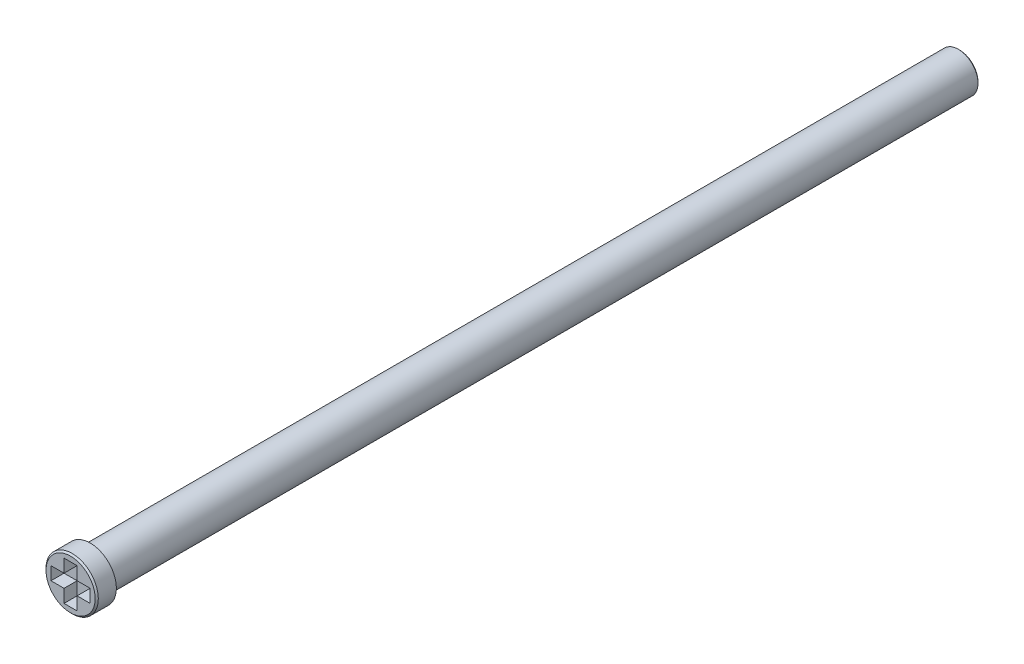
ISO-10303-21;
HEADER;
FILE_DESCRIPTION(('STEP AP214'),'2;1');
FILE_NAME('part.step','',(''),(''),'','','');
FILE_SCHEMA(('AUTOMOTIVE_DESIGN { 1 0 10303 214 1 1 1 1 }'));
ENDSEC;
DATA;
#1=APPLICATION_CONTEXT('core data for automotive mechanical design processes');
#2=APPLICATION_PROTOCOL_DEFINITION('international standard','automotive_design',2000,#1);
#3=PRODUCT_CONTEXT('',#1,'mechanical');
#4=PRODUCT('Part','Part','',(#3));
#5=PRODUCT_RELATED_PRODUCT_CATEGORY('part','',(#4));
#6=PRODUCT_DEFINITION_FORMATION('','',#4);
#7=PRODUCT_DEFINITION_CONTEXT('part definition',#1,'design');
#8=PRODUCT_DEFINITION('design','',#6,#7);
#9=PRODUCT_DEFINITION_SHAPE('','',#8);
#10=(LENGTH_UNIT() NAMED_UNIT(*) SI_UNIT(.MILLI.,.METRE.));
#11=(NAMED_UNIT(*) PLANE_ANGLE_UNIT() SI_UNIT($,.RADIAN.));
#12=(NAMED_UNIT(*) SI_UNIT($,.STERADIAN.) SOLID_ANGLE_UNIT());
#13=UNCERTAINTY_MEASURE_WITH_UNIT(LENGTH_MEASURE(1.E-05),#10,'distance_accuracy_value','');
#14=(GEOMETRIC_REPRESENTATION_CONTEXT(3) GLOBAL_UNCERTAINTY_ASSIGNED_CONTEXT((#13)) GLOBAL_UNIT_ASSIGNED_CONTEXT((#10,
#11,#12)) REPRESENTATION_CONTEXT('',''));
#15=CARTESIAN_POINT('',(0.,0.,0.));
#16=DIRECTION('',(0.,0.,1.));
#17=DIRECTION('',(1.,0.,0.));
#18=AXIS2_PLACEMENT_3D('',#15,#16,#17);
#19=CARTESIAN_POINT('',(0.,0.,68.));
#20=DIRECTION('',(0.,0.,-1.));
#21=DIRECTION('',(-1.,0.,0.));
#22=AXIS2_PLACEMENT_3D('',#19,#20,#21);
#23=CYLINDRICAL_SURFACE('',#22,2.);
#24=CARTESIAN_POINT('',(0.,0.,67.88));
#25=DIRECTION('',(0.,0.,1.));
#26=DIRECTION('',(1.,0.,0.));
#27=AXIS2_PLACEMENT_3D('',#24,#25,#26);
#28=CIRCLE('',#27,2.);
#29=CARTESIAN_POINT('',(2.,0.,67.88));
#30=VERTEX_POINT('',#29);
#31=EDGE_CURVE('E12',#30,#30,#28,.F.);
#32=ORIENTED_EDGE('',*,*,#31,.T.);
#33=EDGE_LOOP('',(#32));
#34=FACE_BOUND('',#33,.T.);
#35=CARTESIAN_POINT('',(0.,0.,66.5));
#36=DIRECTION('',(0.,0.,-1.));
#37=DIRECTION('',(-1.,0.,0.));
#38=AXIS2_PLACEMENT_3D('',#35,#36,#37);
#39=CIRCLE('',#38,2.);
#40=CARTESIAN_POINT('',(-2.,0.,66.5));
#41=VERTEX_POINT('',#40);
#42=EDGE_CURVE('E212',#41,#41,#39,.T.);
#43=ORIENTED_EDGE('',*,*,#42,.F.);
#44=EDGE_LOOP('',(#43));
#45=FACE_BOUND('',#44,.T.);
#46=ADVANCED_FACE('F36',(#34,#45),#23,.T.);
#47=CARTESIAN_POINT('',(0.,0.,68.));
#48=DIRECTION('',(0.,0.,1.));
#49=DIRECTION('',(1.,0.,0.));
#50=AXIS2_PLACEMENT_3D('',#47,#48,#49);
#51=PLANE('',#50);
#52=DIRECTION('',(1.,0.,0.));
#53=VECTOR('',#52,1.);
#54=CARTESIAN_POINT('',(-0.5,-0.5,68.));
#55=LINE('',#54,#53);
#56=CARTESIAN_POINT('',(-1.5,-0.5,68.));
#57=VERTEX_POINT('',#56);
#58=CARTESIAN_POINT('',(-0.5,-0.5,68.));
#59=VERTEX_POINT('',#58);
#60=EDGE_CURVE('E51',#57,#59,#55,.T.);
#61=ORIENTED_EDGE('',*,*,#60,.F.);
#62=DIRECTION('',(0.,-1.,0.));
#63=VECTOR('',#62,1.);
#64=CARTESIAN_POINT('',(-1.5,0.5,68.));
#65=LINE('',#64,#63);
#66=CARTESIAN_POINT('',(-1.5,0.5,68.));
#67=VERTEX_POINT('',#66);
#68=EDGE_CURVE('E188',#67,#57,#65,.T.);
#69=ORIENTED_EDGE('',*,*,#68,.F.);
#70=DIRECTION('',(-1.,0.,0.));
#71=VECTOR('',#70,1.);
#72=CARTESIAN_POINT('',(-0.5,0.5,68.));
#73=LINE('',#72,#71);
#74=CARTESIAN_POINT('',(-0.5,0.5,68.));
#75=VERTEX_POINT('',#74);
#76=EDGE_CURVE('E186',#75,#67,#73,.T.);
#77=ORIENTED_EDGE('',*,*,#76,.F.);
#78=DIRECTION('',(0.,-1.,0.));
#79=VECTOR('',#78,1.);
#80=CARTESIAN_POINT('',(-0.5,0.5,68.));
#81=LINE('',#80,#79);
#82=CARTESIAN_POINT('',(-0.5,1.5,68.));
#83=VERTEX_POINT('',#82);
#84=EDGE_CURVE('E135',#83,#75,#81,.T.);
#85=ORIENTED_EDGE('',*,*,#84,.F.);
#86=DIRECTION('',(-1.,0.,0.));
#87=VECTOR('',#86,1.);
#88=CARTESIAN_POINT('',(0.5,1.5,68.));
#89=LINE('',#88,#87);
#90=CARTESIAN_POINT('',(0.5,1.5,68.));
#91=VERTEX_POINT('',#90);
#92=EDGE_CURVE('E182',#91,#83,#89,.T.);
#93=ORIENTED_EDGE('',*,*,#92,.F.);
#94=DIRECTION('',(0.,1.,0.));
#95=VECTOR('',#94,1.);
#96=CARTESIAN_POINT('',(0.5,0.5,68.));
#97=LINE('',#96,#95);
#98=CARTESIAN_POINT('',(0.5,0.5,68.));
#99=VERTEX_POINT('',#98);
#100=EDGE_CURVE('E179',#99,#91,#97,.T.);
#101=ORIENTED_EDGE('',*,*,#100,.F.);
#102=DIRECTION('',(-1.,0.,0.));
#103=VECTOR('',#102,1.);
#104=CARTESIAN_POINT('',(1.5,0.5,68.));
#105=LINE('',#104,#103);
#106=CARTESIAN_POINT('',(1.5,0.5,68.));
#107=VERTEX_POINT('',#106);
#108=EDGE_CURVE('E176',#107,#99,#105,.T.);
#109=ORIENTED_EDGE('',*,*,#108,.F.);
#110=DIRECTION('',(0.,1.,0.));
#111=VECTOR('',#110,1.);
#112=CARTESIAN_POINT('',(1.5,0.5,68.));
#113=LINE('',#112,#111);
#114=CARTESIAN_POINT('',(1.5,-0.5,68.));
#115=VERTEX_POINT('',#114);
#116=EDGE_CURVE('E173',#115,#107,#113,.T.);
#117=ORIENTED_EDGE('',*,*,#116,.F.);
#118=DIRECTION('',(1.,0.,0.));
#119=VECTOR('',#118,1.);
#120=CARTESIAN_POINT('',(1.5,-0.5,68.));
#121=LINE('',#120,#119);
#122=CARTESIAN_POINT('',(0.5,-0.5,68.));
#123=VERTEX_POINT('',#122);
#124=EDGE_CURVE('E170',#123,#115,#121,.T.);
#125=ORIENTED_EDGE('',*,*,#124,.F.);
#126=DIRECTION('',(0.,1.,0.));
#127=VECTOR('',#126,1.);
#128=CARTESIAN_POINT('',(0.5,-1.5,68.));
#129=LINE('',#128,#127);
#130=CARTESIAN_POINT('',(0.5,-1.5,68.));
#131=VERTEX_POINT('',#130);
#132=EDGE_CURVE('E167',#131,#123,#129,.T.);
#133=ORIENTED_EDGE('',*,*,#132,.F.);
#134=DIRECTION('',(1.,0.,0.));
#135=VECTOR('',#134,1.);
#136=CARTESIAN_POINT('',(0.5,-1.5,68.));
#137=LINE('',#136,#135);
#138=CARTESIAN_POINT('',(-0.5,-1.5,68.));
#139=VERTEX_POINT('',#138);
#140=EDGE_CURVE('E164',#139,#131,#137,.T.);
#141=ORIENTED_EDGE('',*,*,#140,.F.);
#142=DIRECTION('',(0.,-1.,0.));
#143=VECTOR('',#142,1.);
#144=CARTESIAN_POINT('',(-0.5,-1.5,68.));
#145=LINE('',#144,#143);
#146=EDGE_CURVE('E161',#59,#139,#145,.T.);
#147=ORIENTED_EDGE('',*,*,#146,.F.);
#148=EDGE_LOOP('',(#61,#69,#77,#85,#93,#101,#109,#117,#125,#133,#141,#147));
#149=FACE_BOUND('',#148,.T.);
#150=CARTESIAN_POINT('',(0.,0.,68.));
#151=DIRECTION('',(0.,0.,1.));
#152=DIRECTION('',(1.,0.,0.));
#153=AXIS2_PLACEMENT_3D('',#150,#151,#152);
#154=CIRCLE('',#153,1.88000000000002);
#155=CARTESIAN_POINT('',(1.88000000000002,0.,68.));
#156=VERTEX_POINT('',#155);
#157=EDGE_CURVE('E44',#156,#156,#154,.T.);
#158=ORIENTED_EDGE('',*,*,#157,.T.);
#159=EDGE_LOOP('',(#158));
#160=FACE_BOUND('',#159,.T.);
#161=ADVANCED_FACE('F223',(#149,#160),#51,.T.);
#162=CARTESIAN_POINT('',(0.,0.,66.5));
#163=DIRECTION('',(0.,0.,-1.));
#164=DIRECTION('',(-1.,0.,0.));
#165=AXIS2_PLACEMENT_3D('',#162,#163,#164);
#166=PLANE('',#165);
#167=CARTESIAN_POINT('',(0.,0.,66.5));
#168=DIRECTION('',(0.,0.,-1.));
#169=DIRECTION('',(-1.,0.,0.));
#170=AXIS2_PLACEMENT_3D('',#167,#168,#169);
#171=CIRCLE('',#170,1.5);
#172=CARTESIAN_POINT('',(-1.5,0.,66.5));
#173=VERTEX_POINT('',#172);
#174=EDGE_CURVE('E192',#173,#173,#171,.T.);
#175=ORIENTED_EDGE('',*,*,#174,.F.);
#176=EDGE_LOOP('',(#175));
#177=FACE_BOUND('',#176,.T.);
#178=ORIENTED_EDGE('',*,*,#42,.T.);
#179=EDGE_LOOP('',(#178));
#180=FACE_BOUND('',#179,.T.);
#181=ADVANCED_FACE('F244',(#177,#180),#166,.T.);
#182=CARTESIAN_POINT('',(0.,0.,66.5));
#183=DIRECTION('',(0.,0.,-1.));
#184=DIRECTION('',(-1.,0.,0.));
#185=AXIS2_PLACEMENT_3D('',#182,#183,#184);
#186=CYLINDRICAL_SURFACE('',#185,1.5);
#187=CARTESIAN_POINT('',(0.,0.,0.100000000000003));
#188=DIRECTION('',(0.,0.,1.));
#189=DIRECTION('',(1.,0.,0.));
#190=AXIS2_PLACEMENT_3D('',#187,#188,#189);
#191=CIRCLE('',#190,1.5);
#192=CARTESIAN_POINT('',(1.5,0.,0.100000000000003));
#193=VERTEX_POINT('',#192);
#194=EDGE_CURVE('E218',#193,#193,#191,.T.);
#195=ORIENTED_EDGE('',*,*,#194,.T.);
#196=EDGE_LOOP('',(#195));
#197=FACE_BOUND('',#196,.T.);
#198=ORIENTED_EDGE('',*,*,#174,.T.);
#199=EDGE_LOOP('',(#198));
#200=FACE_BOUND('',#199,.T.);
#201=ADVANCED_FACE('F250',(#197,#200),#186,.T.);
#202=CARTESIAN_POINT('',(0.,0.,0.));
#203=DIRECTION('',(0.,0.,1.));
#204=DIRECTION('',(1.,0.,0.));
#205=AXIS2_PLACEMENT_3D('',#202,#203,#204);
#206=PLANE('',#205);
#207=CARTESIAN_POINT('',(0.,0.,0.));
#208=DIRECTION('',(0.,0.,1.));
#209=DIRECTION('',(1.,0.,0.));
#210=AXIS2_PLACEMENT_3D('',#207,#208,#209);
#211=CIRCLE('',#210,1.39999999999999);
#212=CARTESIAN_POINT('',(1.39999999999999,0.,0.));
#213=VERTEX_POINT('',#212);
#214=EDGE_CURVE('E215',#213,#213,#211,.F.);
#215=ORIENTED_EDGE('',*,*,#214,.T.);
#216=EDGE_LOOP('',(#215));
#217=FACE_BOUND('',#216,.T.);
#218=ADVANCED_FACE('F235',(#217),#206,.F.);
#219=CARTESIAN_POINT('',(0.,0.,0.));
#220=DIRECTION('',(0.,0.,1.));
#221=DIRECTION('',(1.,0.,0.));
#222=AXIS2_PLACEMENT_3D('',#219,#220,#221);
#223=CONICAL_SURFACE('',#222,1.39999999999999,0.785398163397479);
#224=ORIENTED_EDGE('',*,*,#194,.F.);
#225=EDGE_LOOP('',(#224));
#226=FACE_BOUND('',#225,.T.);
#227=ORIENTED_EDGE('',*,*,#214,.F.);
#228=EDGE_LOOP('',(#227));
#229=FACE_BOUND('',#228,.T.);
#230=ADVANCED_FACE('F227',(#226,#229),#223,.T.);
#231=CARTESIAN_POINT('',(0.,0.,68.));
#232=DIRECTION('',(0.,0.,-1.));
#233=DIRECTION('',(-1.,0.,0.));
#234=AXIS2_PLACEMENT_3D('',#231,#232,#233);
#235=CONICAL_SURFACE('',#234,1.88000000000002,0.785398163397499);
#236=ORIENTED_EDGE('',*,*,#31,.F.);
#237=EDGE_LOOP('',(#236));
#238=FACE_BOUND('',#237,.T.);
#239=ORIENTED_EDGE('',*,*,#157,.F.);
#240=EDGE_LOOP('',(#239));
#241=FACE_BOUND('',#240,.T.);
#242=ADVANCED_FACE('F38',(#238,#241),#235,.T.);
#243=CARTESIAN_POINT('',(-0.5,-0.5,67.));
#244=DIRECTION('',(0.,-1.,0.));
#245=DIRECTION('',(1.,0.,0.));
#246=AXIS2_PLACEMENT_3D('',#243,#244,#245);
#247=PLANE('',#246);
#248=ORIENTED_EDGE('',*,*,#60,.T.);
#249=DIRECTION('',(0.,0.,1.));
#250=VECTOR('',#249,1.);
#251=CARTESIAN_POINT('',(-0.5,-0.5,67.));
#252=LINE('',#251,#250);
#253=CARTESIAN_POINT('',(-0.5,-0.5,67.));
#254=VERTEX_POINT('',#253);
#255=EDGE_CURVE('E99',#254,#59,#252,.T.);
#256=ORIENTED_EDGE('',*,*,#255,.F.);
#257=DIRECTION('',(1.,0.,0.));
#258=VECTOR('',#257,1.);
#259=CARTESIAN_POINT('',(-0.5,-0.5,67.));
#260=LINE('',#259,#258);
#261=CARTESIAN_POINT('',(-1.5,-0.5,67.));
#262=VERTEX_POINT('',#261);
#263=EDGE_CURVE('E190',#262,#254,#260,.T.);
#264=ORIENTED_EDGE('',*,*,#263,.F.);
#265=DIRECTION('',(0.,0.,1.));
#266=VECTOR('',#265,1.);
#267=CARTESIAN_POINT('',(-1.5,-0.5,67.));
#268=LINE('',#267,#266);
#269=EDGE_CURVE('E59',#262,#57,#268,.T.);
#270=ORIENTED_EDGE('',*,*,#269,.T.);
#271=EDGE_LOOP('',(#248,#256,#264,#270));
#272=FACE_BOUND('',#271,.T.);
#273=ADVANCED_FACE('F226',(#272),#247,.F.);
#274=CARTESIAN_POINT('',(-1.5,0.5,67.));
#275=DIRECTION('',(-1.,0.,0.));
#276=DIRECTION('',(0.,-1.,0.));
#277=AXIS2_PLACEMENT_3D('',#274,#275,#276);
#278=PLANE('',#277);
#279=ORIENTED_EDGE('',*,*,#68,.T.);
#280=ORIENTED_EDGE('',*,*,#269,.F.);
#281=DIRECTION('',(0.,-1.,0.));
#282=VECTOR('',#281,1.);
#283=CARTESIAN_POINT('',(-1.5,0.5,67.));
#284=LINE('',#283,#282);
#285=CARTESIAN_POINT('',(-1.5,0.5,67.));
#286=VERTEX_POINT('',#285);
#287=EDGE_CURVE('E147',#286,#262,#284,.T.);
#288=ORIENTED_EDGE('',*,*,#287,.F.);
#289=DIRECTION('',(0.,0.,1.));
#290=VECTOR('',#289,1.);
#291=CARTESIAN_POINT('',(-1.5,0.5,67.));
#292=LINE('',#291,#290);
#293=EDGE_CURVE('E139',#286,#67,#292,.T.);
#294=ORIENTED_EDGE('',*,*,#293,.T.);
#295=EDGE_LOOP('',(#279,#280,#288,#294));
#296=FACE_BOUND('',#295,.T.);
#297=ADVANCED_FACE('F233',(#296),#278,.F.);
#298=CARTESIAN_POINT('',(-0.5,0.5,67.));
#299=DIRECTION('',(0.,1.,0.));
#300=DIRECTION('',(0.,0.,1.));
#301=AXIS2_PLACEMENT_3D('',#298,#299,#300);
#302=PLANE('',#301);
#303=ORIENTED_EDGE('',*,*,#76,.T.);
#304=ORIENTED_EDGE('',*,*,#293,.F.);
#305=DIRECTION('',(-1.,0.,0.));
#306=VECTOR('',#305,1.);
#307=CARTESIAN_POINT('',(-0.5,0.5,67.));
#308=LINE('',#307,#306);
#309=CARTESIAN_POINT('',(-0.5,0.5,67.));
#310=VERTEX_POINT('',#309);
#311=EDGE_CURVE('E143',#310,#286,#308,.T.);
#312=ORIENTED_EDGE('',*,*,#311,.F.);
#313=DIRECTION('',(0.,0.,1.));
#314=VECTOR('',#313,1.);
#315=CARTESIAN_POINT('',(-0.5,0.5,67.));
#316=LINE('',#315,#314);
#317=EDGE_CURVE('E128',#310,#75,#316,.T.);
#318=ORIENTED_EDGE('',*,*,#317,.T.);
#319=EDGE_LOOP('',(#303,#304,#312,#318));
#320=FACE_BOUND('',#319,.T.);
#321=ADVANCED_FACE('F144',(#320),#302,.F.);
#322=CARTESIAN_POINT('',(-0.5,0.5,67.));
#323=DIRECTION('',(-1.,0.,0.));
#324=DIRECTION('',(0.,-1.,0.));
#325=AXIS2_PLACEMENT_3D('',#322,#323,#324);
#326=PLANE('',#325);
#327=ORIENTED_EDGE('',*,*,#84,.T.);
#328=ORIENTED_EDGE('',*,*,#317,.F.);
#329=DIRECTION('',(0.,-1.,0.));
#330=VECTOR('',#329,1.);
#331=CARTESIAN_POINT('',(-0.5,0.5,67.));
#332=LINE('',#331,#330);
#333=CARTESIAN_POINT('',(-0.5,1.5,67.));
#334=VERTEX_POINT('',#333);
#335=EDGE_CURVE('E132',#334,#310,#332,.T.);
#336=ORIENTED_EDGE('',*,*,#335,.F.);
#337=DIRECTION('',(0.,0.,1.));
#338=VECTOR('',#337,1.);
#339=CARTESIAN_POINT('',(-0.5,1.5,67.));
#340=LINE('',#339,#338);
#341=EDGE_CURVE('E140',#334,#83,#340,.T.);
#342=ORIENTED_EDGE('',*,*,#341,.T.);
#343=EDGE_LOOP('',(#327,#328,#336,#342));
#344=FACE_BOUND('',#343,.T.);
#345=ADVANCED_FACE('F130',(#344),#326,.F.);
#346=CARTESIAN_POINT('',(0.5,1.5,67.));
#347=DIRECTION('',(0.,1.,0.));
#348=DIRECTION('',(-1.,0.,0.));
#349=AXIS2_PLACEMENT_3D('',#346,#347,#348);
#350=PLANE('',#349);
#351=ORIENTED_EDGE('',*,*,#92,.T.);
#352=ORIENTED_EDGE('',*,*,#341,.F.);
#353=DIRECTION('',(-1.,0.,0.));
#354=VECTOR('',#353,1.);
#355=CARTESIAN_POINT('',(0.5,1.5,67.));
#356=LINE('',#355,#354);
#357=CARTESIAN_POINT('',(0.5,1.5,67.));
#358=VERTEX_POINT('',#357);
#359=EDGE_CURVE('E153',#358,#334,#356,.T.);
#360=ORIENTED_EDGE('',*,*,#359,.F.);
#361=DIRECTION('',(0.,0.,1.));
#362=VECTOR('',#361,1.);
#363=CARTESIAN_POINT('',(0.5,1.5,67.));
#364=LINE('',#363,#362);
#365=EDGE_CURVE('E195',#358,#91,#364,.T.);
#366=ORIENTED_EDGE('',*,*,#365,.T.);
#367=EDGE_LOOP('',(#351,#352,#360,#366));
#368=FACE_BOUND('',#367,.T.);
#369=ADVANCED_FACE('F286',(#368),#350,.F.);
#370=CARTESIAN_POINT('',(0.5,0.5,67.));
#371=DIRECTION('',(1.,0.,0.));
#372=DIRECTION('',(0.,1.,0.));
#373=AXIS2_PLACEMENT_3D('',#370,#371,#372);
#374=PLANE('',#373);
#375=ORIENTED_EDGE('',*,*,#100,.T.);
#376=ORIENTED_EDGE('',*,*,#365,.F.);
#377=DIRECTION('',(0.,1.,0.));
#378=VECTOR('',#377,1.);
#379=CARTESIAN_POINT('',(0.5,0.5,67.));
#380=LINE('',#379,#378);
#381=CARTESIAN_POINT('',(0.5,0.5,67.));
#382=VERTEX_POINT('',#381);
#383=EDGE_CURVE('E155',#382,#358,#380,.T.);
#384=ORIENTED_EDGE('',*,*,#383,.F.);
#385=DIRECTION('',(0.,0.,1.));
#386=VECTOR('',#385,1.);
#387=CARTESIAN_POINT('',(0.5,0.5,67.));
#388=LINE('',#387,#386);
#389=EDGE_CURVE('E197',#382,#99,#388,.T.);
#390=ORIENTED_EDGE('',*,*,#389,.T.);
#391=EDGE_LOOP('',(#375,#376,#384,#390));
#392=FACE_BOUND('',#391,.T.);
#393=ADVANCED_FACE('F282',(#392),#374,.F.);
#394=CARTESIAN_POINT('',(1.5,0.5,67.));
#395=DIRECTION('',(0.,1.,0.));
#396=DIRECTION('',(-1.,0.,0.));
#397=AXIS2_PLACEMENT_3D('',#394,#395,#396);
#398=PLANE('',#397);
#399=ORIENTED_EDGE('',*,*,#108,.T.);
#400=ORIENTED_EDGE('',*,*,#389,.F.);
#401=DIRECTION('',(-1.,0.,0.));
#402=VECTOR('',#401,1.);
#403=CARTESIAN_POINT('',(1.5,0.5,67.));
#404=LINE('',#403,#402);
#405=CARTESIAN_POINT('',(1.5,0.5,67.));
#406=VERTEX_POINT('',#405);
#407=EDGE_CURVE('E436',#406,#382,#404,.T.);
#408=ORIENTED_EDGE('',*,*,#407,.F.);
#409=DIRECTION('',(0.,0.,1.));
#410=VECTOR('',#409,1.);
#411=CARTESIAN_POINT('',(1.5,0.5,67.));
#412=LINE('',#411,#410);
#413=EDGE_CURVE('E199',#406,#107,#412,.T.);
#414=ORIENTED_EDGE('',*,*,#413,.T.);
#415=EDGE_LOOP('',(#399,#400,#408,#414));
#416=FACE_BOUND('',#415,.T.);
#417=ADVANCED_FACE('F278',(#416),#398,.F.);
#418=CARTESIAN_POINT('',(1.5,0.5,67.));
#419=DIRECTION('',(1.,0.,0.));
#420=DIRECTION('',(0.,1.,0.));
#421=AXIS2_PLACEMENT_3D('',#418,#419,#420);
#422=PLANE('',#421);
#423=ORIENTED_EDGE('',*,*,#116,.T.);
#424=ORIENTED_EDGE('',*,*,#413,.F.);
#425=DIRECTION('',(0.,1.,0.));
#426=VECTOR('',#425,1.);
#427=CARTESIAN_POINT('',(1.5,0.5,67.));
#428=LINE('',#427,#426);
#429=CARTESIAN_POINT('',(1.5,-0.5,67.));
#430=VERTEX_POINT('',#429);
#431=EDGE_CURVE('E433',#430,#406,#428,.T.);
#432=ORIENTED_EDGE('',*,*,#431,.F.);
#433=DIRECTION('',(0.,0.,1.));
#434=VECTOR('',#433,1.);
#435=CARTESIAN_POINT('',(1.5,-0.5,67.));
#436=LINE('',#435,#434);
#437=EDGE_CURVE('E201',#430,#115,#436,.T.);
#438=ORIENTED_EDGE('',*,*,#437,.T.);
#439=EDGE_LOOP('',(#423,#424,#432,#438));
#440=FACE_BOUND('',#439,.T.);
#441=ADVANCED_FACE('F274',(#440),#422,.F.);
#442=CARTESIAN_POINT('',(1.5,-0.5,67.));
#443=DIRECTION('',(0.,-1.,0.));
#444=DIRECTION('',(0.,0.,-1.));
#445=AXIS2_PLACEMENT_3D('',#442,#443,#444);
#446=PLANE('',#445);
#447=ORIENTED_EDGE('',*,*,#124,.T.);
#448=ORIENTED_EDGE('',*,*,#437,.F.);
#449=DIRECTION('',(1.,0.,0.));
#450=VECTOR('',#449,1.);
#451=CARTESIAN_POINT('',(1.5,-0.5,67.));
#452=LINE('',#451,#450);
#453=CARTESIAN_POINT('',(0.5,-0.5,67.));
#454=VERTEX_POINT('',#453);
#455=EDGE_CURVE('E430',#454,#430,#452,.T.);
#456=ORIENTED_EDGE('',*,*,#455,.F.);
#457=DIRECTION('',(0.,0.,1.));
#458=VECTOR('',#457,1.);
#459=CARTESIAN_POINT('',(0.5,-0.5,67.));
#460=LINE('',#459,#458);
#461=EDGE_CURVE('E203',#454,#123,#460,.T.);
#462=ORIENTED_EDGE('',*,*,#461,.T.);
#463=EDGE_LOOP('',(#447,#448,#456,#462));
#464=FACE_BOUND('',#463,.T.);
#465=ADVANCED_FACE('F270',(#464),#446,.F.);
#466=CARTESIAN_POINT('',(0.5,-1.5,67.));
#467=DIRECTION('',(1.,0.,0.));
#468=DIRECTION('',(0.,0.,-1.));
#469=AXIS2_PLACEMENT_3D('',#466,#467,#468);
#470=PLANE('',#469);
#471=ORIENTED_EDGE('',*,*,#132,.T.);
#472=ORIENTED_EDGE('',*,*,#461,.F.);
#473=DIRECTION('',(0.,1.,0.));
#474=VECTOR('',#473,1.);
#475=CARTESIAN_POINT('',(0.5,-1.5,67.));
#476=LINE('',#475,#474);
#477=CARTESIAN_POINT('',(0.5,-1.5,67.));
#478=VERTEX_POINT('',#477);
#479=EDGE_CURVE('E427',#478,#454,#476,.T.);
#480=ORIENTED_EDGE('',*,*,#479,.F.);
#481=DIRECTION('',(0.,0.,1.));
#482=VECTOR('',#481,1.);
#483=CARTESIAN_POINT('',(0.5,-1.5,67.));
#484=LINE('',#483,#482);
#485=EDGE_CURVE('E205',#478,#131,#484,.T.);
#486=ORIENTED_EDGE('',*,*,#485,.T.);
#487=EDGE_LOOP('',(#471,#472,#480,#486));
#488=FACE_BOUND('',#487,.T.);
#489=ADVANCED_FACE('F266',(#488),#470,.F.);
#490=CARTESIAN_POINT('',(0.5,-1.5,67.));
#491=DIRECTION('',(0.,-1.,0.));
#492=DIRECTION('',(0.,0.,-1.));
#493=AXIS2_PLACEMENT_3D('',#490,#491,#492);
#494=PLANE('',#493);
#495=ORIENTED_EDGE('',*,*,#140,.T.);
#496=ORIENTED_EDGE('',*,*,#485,.F.);
#497=DIRECTION('',(1.,0.,0.));
#498=VECTOR('',#497,1.);
#499=CARTESIAN_POINT('',(0.5,-1.5,67.));
#500=LINE('',#499,#498);
#501=CARTESIAN_POINT('',(-0.5,-1.5,67.));
#502=VERTEX_POINT('',#501);
#503=EDGE_CURVE('E422',#502,#478,#500,.T.);
#504=ORIENTED_EDGE('',*,*,#503,.F.);
#505=DIRECTION('',(0.,0.,1.));
#506=VECTOR('',#505,1.);
#507=CARTESIAN_POINT('',(-0.5,-1.5,67.));
#508=LINE('',#507,#506);
#509=EDGE_CURVE('E207',#502,#139,#508,.T.);
#510=ORIENTED_EDGE('',*,*,#509,.T.);
#511=EDGE_LOOP('',(#495,#496,#504,#510));
#512=FACE_BOUND('',#511,.T.);
#513=ADVANCED_FACE('F262',(#512),#494,.F.);
#514=CARTESIAN_POINT('',(-0.5,-1.5,67.));
#515=DIRECTION('',(-1.,0.,0.));
#516=DIRECTION('',(0.,-1.,0.));
#517=AXIS2_PLACEMENT_3D('',#514,#515,#516);
#518=PLANE('',#517);
#519=ORIENTED_EDGE('',*,*,#146,.T.);
#520=ORIENTED_EDGE('',*,*,#509,.F.);
#521=DIRECTION('',(0.,-1.,0.));
#522=VECTOR('',#521,1.);
#523=CARTESIAN_POINT('',(-0.5,-1.5,67.));
#524=LINE('',#523,#522);
#525=EDGE_CURVE('E420',#254,#502,#524,.T.);
#526=ORIENTED_EDGE('',*,*,#525,.F.);
#527=ORIENTED_EDGE('',*,*,#255,.T.);
#528=EDGE_LOOP('',(#519,#520,#526,#527));
#529=FACE_BOUND('',#528,.T.);
#530=ADVANCED_FACE('F259',(#529),#518,.F.);
#531=CARTESIAN_POINT('',(0.,0.,67.));
#532=DIRECTION('',(0.,0.,1.));
#533=DIRECTION('',(1.,0.,0.));
#534=AXIS2_PLACEMENT_3D('',#531,#532,#533);
#535=PLANE('',#534);
#536=ORIENTED_EDGE('',*,*,#263,.T.);
#537=ORIENTED_EDGE('',*,*,#525,.T.);
#538=ORIENTED_EDGE('',*,*,#503,.T.);
#539=ORIENTED_EDGE('',*,*,#479,.T.);
#540=ORIENTED_EDGE('',*,*,#455,.T.);
#541=ORIENTED_EDGE('',*,*,#431,.T.);
#542=ORIENTED_EDGE('',*,*,#407,.T.);
#543=ORIENTED_EDGE('',*,*,#383,.T.);
#544=ORIENTED_EDGE('',*,*,#359,.T.);
#545=ORIENTED_EDGE('',*,*,#335,.T.);
#546=ORIENTED_EDGE('',*,*,#311,.T.);
#547=ORIENTED_EDGE('',*,*,#287,.T.);
#548=EDGE_LOOP('',(#536,#537,#538,#539,#540,#541,#542,#543,#544,#545,#546,#547));
#549=FACE_BOUND('',#548,.T.);
#550=ADVANCED_FACE('F150',(#549),#535,.T.);
#551=CLOSED_SHELL('',(#46,#161,#181,#201,#218,#230,#242,#273,#297,#321,#345,#369,#393,#417,#441,
#465,#489,#513,#530,#550));
#552=MANIFOLD_SOLID_BREP('B2',#551);
#553=ADVANCED_BREP_SHAPE_REPRESENTATION('',(#18,#552),#14);
#554=SHAPE_DEFINITION_REPRESENTATION(#9,#553);
ENDSEC;
END-ISO-10303-21;
